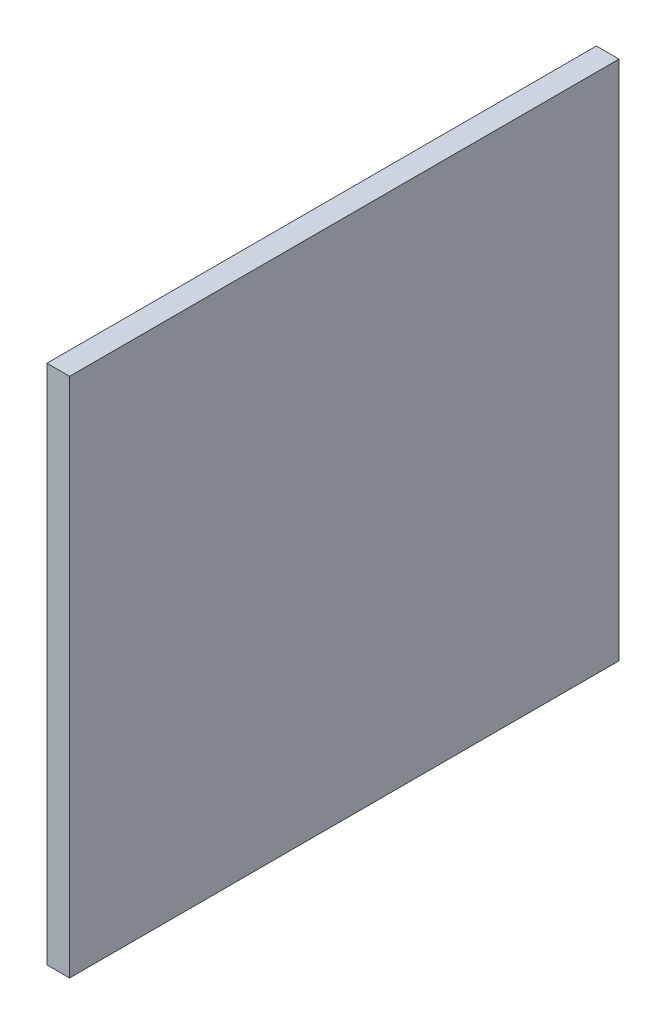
ISO-10303-21;
HEADER;
FILE_DESCRIPTION(('STEP AP214'),'2;1');
FILE_NAME('part.step','',(''),(''),'','','');
FILE_SCHEMA(('AUTOMOTIVE_DESIGN { 1 0 10303 214 1 1 1 1 }'));
ENDSEC;
DATA;
#1=APPLICATION_CONTEXT('core data for automotive mechanical design processes');
#2=APPLICATION_PROTOCOL_DEFINITION('international standard','automotive_design',2000,#1);
#3=PRODUCT_CONTEXT('',#1,'mechanical');
#4=PRODUCT('Part','Part','',(#3));
#5=PRODUCT_RELATED_PRODUCT_CATEGORY('part','',(#4));
#6=PRODUCT_DEFINITION_FORMATION('','',#4);
#7=PRODUCT_DEFINITION_CONTEXT('part definition',#1,'design');
#8=PRODUCT_DEFINITION('design','',#6,#7);
#9=PRODUCT_DEFINITION_SHAPE('','',#8);
#10=(LENGTH_UNIT() NAMED_UNIT(*) SI_UNIT(.MILLI.,.METRE.));
#11=(NAMED_UNIT(*) PLANE_ANGLE_UNIT() SI_UNIT($,.RADIAN.));
#12=(NAMED_UNIT(*) SI_UNIT($,.STERADIAN.) SOLID_ANGLE_UNIT());
#13=UNCERTAINTY_MEASURE_WITH_UNIT(LENGTH_MEASURE(1.E-05),#10,'distance_accuracy_value','');
#14=(GEOMETRIC_REPRESENTATION_CONTEXT(3) GLOBAL_UNCERTAINTY_ASSIGNED_CONTEXT((#13)) GLOBAL_UNIT_ASSIGNED_CONTEXT((#10,
#11,#12)) REPRESENTATION_CONTEXT('',''));
#15=CARTESIAN_POINT('',(0.,0.,0.));
#16=DIRECTION('',(0.,0.,1.));
#17=DIRECTION('',(1.,0.,0.));
#18=AXIS2_PLACEMENT_3D('',#15,#16,#17);
#19=CARTESIAN_POINT('',(40.,0.,0.));
#20=DIRECTION('',(0.,0.,-1.));
#21=DIRECTION('',(-1.,0.,0.));
#22=AXIS2_PLACEMENT_3D('',#19,#20,#21);
#23=PLANE('',#22);
#24=DIRECTION('',(0.,-1.,0.));
#25=VECTOR('',#24,1.);
#26=CARTESIAN_POINT('',(0.,0.,0.));
#27=LINE('',#26,#25);
#28=CARTESIAN_POINT('',(0.,920.,0.));
#29=VERTEX_POINT('',#28);
#30=CARTESIAN_POINT('',(0.,0.,0.));
#31=VERTEX_POINT('',#30);
#32=EDGE_CURVE('E113',#29,#31,#27,.T.);
#33=ORIENTED_EDGE('',*,*,#32,.T.);
#34=DIRECTION('',(-1.,0.,0.));
#35=VECTOR('',#34,1.);
#36=CARTESIAN_POINT('',(40.,0.,0.));
#37=LINE('',#36,#35);
#38=CARTESIAN_POINT('',(40.,0.,0.));
#39=VERTEX_POINT('',#38);
#40=EDGE_CURVE('E11',#39,#31,#37,.T.);
#41=ORIENTED_EDGE('',*,*,#40,.F.);
#42=DIRECTION('',(0.,-1.,0.));
#43=VECTOR('',#42,1.);
#44=CARTESIAN_POINT('',(40.,0.,0.));
#45=LINE('',#44,#43);
#46=CARTESIAN_POINT('',(40.,920.,0.));
#47=VERTEX_POINT('',#46);
#48=EDGE_CURVE('E97',#47,#39,#45,.T.);
#49=ORIENTED_EDGE('',*,*,#48,.F.);
#50=DIRECTION('',(-1.,0.,0.));
#51=VECTOR('',#50,1.);
#52=CARTESIAN_POINT('',(40.,920.,0.));
#53=LINE('',#52,#51);
#54=EDGE_CURVE('E109',#47,#29,#53,.T.);
#55=ORIENTED_EDGE('',*,*,#54,.T.);
#56=EDGE_LOOP('',(#33,#41,#49,#55));
#57=FACE_BOUND('',#56,.T.);
#58=ADVANCED_FACE('F45',(#57),#23,.F.);
#59=CARTESIAN_POINT('',(40.,0.,0.));
#60=DIRECTION('',(0.,1.,0.));
#61=DIRECTION('',(0.,0.,1.));
#62=AXIS2_PLACEMENT_3D('',#59,#60,#61);
#63=PLANE('',#62);
#64=DIRECTION('',(0.,0.,-1.));
#65=VECTOR('',#64,1.);
#66=CARTESIAN_POINT('',(0.,0.,0.));
#67=LINE('',#66,#65);
#68=CARTESIAN_POINT('',(0.,0.,-970.));
#69=VERTEX_POINT('',#68);
#70=EDGE_CURVE('E102',#31,#69,#67,.T.);
#71=ORIENTED_EDGE('',*,*,#70,.T.);
#72=DIRECTION('',(-1.,0.,0.));
#73=VECTOR('',#72,1.);
#74=CARTESIAN_POINT('',(40.,0.,-970.));
#75=LINE('',#74,#73);
#76=CARTESIAN_POINT('',(40.,0.,-970.));
#77=VERTEX_POINT('',#76);
#78=EDGE_CURVE('E54',#77,#69,#75,.T.);
#79=ORIENTED_EDGE('',*,*,#78,.F.);
#80=DIRECTION('',(0.,0.,-1.));
#81=VECTOR('',#80,1.);
#82=CARTESIAN_POINT('',(40.,0.,0.));
#83=LINE('',#82,#81);
#84=EDGE_CURVE('E92',#39,#77,#83,.T.);
#85=ORIENTED_EDGE('',*,*,#84,.F.);
#86=ORIENTED_EDGE('',*,*,#40,.T.);
#87=EDGE_LOOP('',(#71,#79,#85,#86));
#88=FACE_BOUND('',#87,.T.);
#89=ADVANCED_FACE('F101',(#88),#63,.F.);
#90=CARTESIAN_POINT('',(40.,0.,-970.));
#91=DIRECTION('',(0.,0.,1.));
#92=DIRECTION('',(1.,0.,0.));
#93=AXIS2_PLACEMENT_3D('',#90,#91,#92);
#94=PLANE('',#93);
#95=DIRECTION('',(0.,1.,0.));
#96=VECTOR('',#95,1.);
#97=CARTESIAN_POINT('',(0.,0.,-970.));
#98=LINE('',#97,#96);
#99=CARTESIAN_POINT('',(0.,920.,-970.));
#100=VERTEX_POINT('',#99);
#101=EDGE_CURVE('E79',#69,#100,#98,.T.);
#102=ORIENTED_EDGE('',*,*,#101,.T.);
#103=DIRECTION('',(-1.,0.,0.));
#104=VECTOR('',#103,1.);
#105=CARTESIAN_POINT('',(40.,920.,-970.));
#106=LINE('',#105,#104);
#107=CARTESIAN_POINT('',(40.,920.,-970.));
#108=VERTEX_POINT('',#107);
#109=EDGE_CURVE('E104',#108,#100,#106,.T.);
#110=ORIENTED_EDGE('',*,*,#109,.F.);
#111=DIRECTION('',(0.,1.,0.));
#112=VECTOR('',#111,1.);
#113=CARTESIAN_POINT('',(40.,0.,-970.));
#114=LINE('',#113,#112);
#115=EDGE_CURVE('E95',#77,#108,#114,.T.);
#116=ORIENTED_EDGE('',*,*,#115,.F.);
#117=ORIENTED_EDGE('',*,*,#78,.T.);
#118=EDGE_LOOP('',(#102,#110,#116,#117));
#119=FACE_BOUND('',#118,.T.);
#120=ADVANCED_FACE('F105',(#119),#94,.F.);
#121=CARTESIAN_POINT('',(40.,920.,0.));
#122=DIRECTION('',(0.,-1.,0.));
#123=DIRECTION('',(0.,0.,-1.));
#124=AXIS2_PLACEMENT_3D('',#121,#122,#123);
#125=PLANE('',#124);
#126=DIRECTION('',(0.,0.,1.));
#127=VECTOR('',#126,1.);
#128=CARTESIAN_POINT('',(0.,920.,0.));
#129=LINE('',#128,#127);
#130=EDGE_CURVE('E85',#100,#29,#129,.T.);
#131=ORIENTED_EDGE('',*,*,#130,.T.);
#132=ORIENTED_EDGE('',*,*,#54,.F.);
#133=DIRECTION('',(0.,0.,1.));
#134=VECTOR('',#133,1.);
#135=CARTESIAN_POINT('',(40.,920.,0.));
#136=LINE('',#135,#134);
#137=EDGE_CURVE('E62',#108,#47,#136,.T.);
#138=ORIENTED_EDGE('',*,*,#137,.F.);
#139=ORIENTED_EDGE('',*,*,#109,.T.);
#140=EDGE_LOOP('',(#131,#132,#138,#139));
#141=FACE_BOUND('',#140,.T.);
#142=ADVANCED_FACE('F126',(#141),#125,.F.);
#143=CARTESIAN_POINT('',(40.,0.,0.));
#144=DIRECTION('',(-1.,0.,0.));
#145=DIRECTION('',(0.,0.,1.));
#146=AXIS2_PLACEMENT_3D('',#143,#144,#145);
#147=PLANE('',#146);
#148=ORIENTED_EDGE('',*,*,#48,.T.);
#149=ORIENTED_EDGE('',*,*,#84,.T.);
#150=ORIENTED_EDGE('',*,*,#115,.T.);
#151=ORIENTED_EDGE('',*,*,#137,.T.);
#152=EDGE_LOOP('',(#148,#149,#150,#151));
#153=FACE_BOUND('',#152,.T.);
#154=ADVANCED_FACE('F93',(#153),#147,.F.);
#155=CARTESIAN_POINT('',(0.,0.,0.));
#156=DIRECTION('',(-1.,0.,0.));
#157=DIRECTION('',(0.,0.,1.));
#158=AXIS2_PLACEMENT_3D('',#155,#156,#157);
#159=PLANE('',#158);
#160=ORIENTED_EDGE('',*,*,#32,.F.);
#161=ORIENTED_EDGE('',*,*,#130,.F.);
#162=ORIENTED_EDGE('',*,*,#101,.F.);
#163=ORIENTED_EDGE('',*,*,#70,.F.);
#164=EDGE_LOOP('',(#160,#161,#162,#163));
#165=FACE_BOUND('',#164,.T.);
#166=ADVANCED_FACE('F129',(#165),#159,.T.);
#167=CLOSED_SHELL('',(#58,#89,#120,#142,#154,#166));
#168=MANIFOLD_SOLID_BREP('B2',#167);
#169=ADVANCED_BREP_SHAPE_REPRESENTATION('',(#18,#168),#14);
#170=SHAPE_DEFINITION_REPRESENTATION(#9,#169);
ENDSEC;
END-ISO-10303-21;
